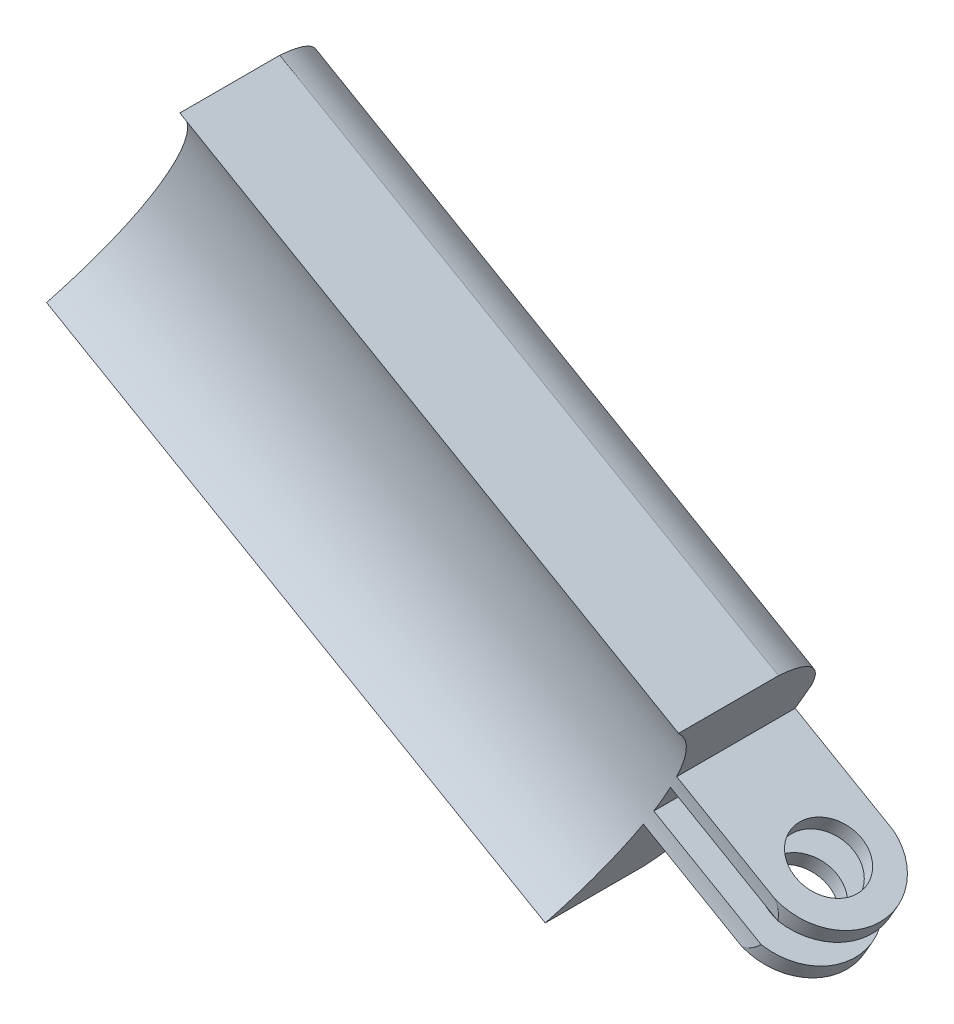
ISO-10303-21;
HEADER;
FILE_DESCRIPTION(('STEP AP214'),'2;1');
FILE_NAME('part.step','',(''),(''),'','','');
FILE_SCHEMA(('AUTOMOTIVE_DESIGN { 1 0 10303 214 1 1 1 1 }'));
ENDSEC;
DATA;
#1=APPLICATION_CONTEXT('core data for automotive mechanical design processes');
#2=APPLICATION_PROTOCOL_DEFINITION('international standard','automotive_design',2000,#1);
#3=PRODUCT_CONTEXT('',#1,'mechanical');
#4=PRODUCT('Part','Part','',(#3));
#5=PRODUCT_RELATED_PRODUCT_CATEGORY('part','',(#4));
#6=PRODUCT_DEFINITION_FORMATION('','',#4);
#7=PRODUCT_DEFINITION_CONTEXT('part definition',#1,'design');
#8=PRODUCT_DEFINITION('design','',#6,#7);
#9=PRODUCT_DEFINITION_SHAPE('','',#8);
#10=(LENGTH_UNIT() NAMED_UNIT(*) SI_UNIT(.MILLI.,.METRE.));
#11=(NAMED_UNIT(*) PLANE_ANGLE_UNIT() SI_UNIT($,.RADIAN.));
#12=(NAMED_UNIT(*) SI_UNIT($,.STERADIAN.) SOLID_ANGLE_UNIT());
#13=UNCERTAINTY_MEASURE_WITH_UNIT(LENGTH_MEASURE(1.E-05),#10,'distance_accuracy_value','');
#14=(GEOMETRIC_REPRESENTATION_CONTEXT(3) GLOBAL_UNCERTAINTY_ASSIGNED_CONTEXT((#13)) GLOBAL_UNIT_ASSIGNED_CONTEXT((#10,
#11,#12)) REPRESENTATION_CONTEXT('',''));
#15=CARTESIAN_POINT('',(0.,0.,0.));
#16=DIRECTION('',(0.,0.,1.));
#17=DIRECTION('',(1.,0.,0.));
#18=AXIS2_PLACEMENT_3D('',#15,#16,#17);
#19=CARTESIAN_POINT('',(-21.1050126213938,20.3218026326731,10.));
#20=DIRECTION('',(-0.866025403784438,0.500000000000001,0.));
#21=DIRECTION('',(-0.500000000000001,-0.866025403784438,0.));
#22=AXIS2_PLACEMENT_3D('',#19,#20,#21);
#23=PLANE('',#22);
#24=DIRECTION('',(0.,0.,-1.));
#25=VECTOR('',#24,1.);
#26=CARTESIAN_POINT('',(-18.1050126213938,25.5179550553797,7.11211234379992));
#27=LINE('',#26,#25);
#28=CARTESIAN_POINT('',(-18.1050126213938,25.5179550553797,7.11211234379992));
#29=VERTEX_POINT('',#28);
#30=CARTESIAN_POINT('',(-18.1050126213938,25.5179550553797,0.));
#31=VERTEX_POINT('',#30);
#32=EDGE_CURVE('E165',#29,#31,#27,.T.);
#33=ORIENTED_EDGE('',*,*,#32,.F.);
#34=CARTESIAN_POINT('',(-17.1050126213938,27.2500058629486,18.9442719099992));
#35=DIRECTION('',(-0.866025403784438,0.500000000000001,0.));
#36=DIRECTION('',(-0.500000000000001,-0.866025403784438,0.));
#37=AXIS2_PLACEMENT_3D('',#34,#35,#36);
#38=CIRCLE('',#37,12.);
#39=CARTESIAN_POINT('',(-21.1050126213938,20.3218026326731,10.));
#40=VERTEX_POINT('',#39);
#41=EDGE_CURVE('E11',#40,#29,#38,.F.);
#42=ORIENTED_EDGE('',*,*,#41,.F.);
#43=DIRECTION('',(0.,0.,-1.));
#44=VECTOR('',#43,1.);
#45=CARTESIAN_POINT('',(-21.1050126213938,20.3218026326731,10.));
#46=LINE('',#45,#44);
#47=CARTESIAN_POINT('',(-21.1050126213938,20.3218026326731,4.));
#48=VERTEX_POINT('',#47);
#49=EDGE_CURVE('E226',#40,#48,#46,.T.);
#50=ORIENTED_EDGE('',*,*,#49,.T.);
#51=CARTESIAN_POINT('',(-18.6472746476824,24.5787296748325,4.91547594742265));
#52=DIRECTION('',(-0.866025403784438,0.500000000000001,0.));
#53=DIRECTION('',(-0.500000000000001,-0.866025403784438,0.));
#54=AXIS2_PLACEMENT_3D('',#51,#52,#53);
#55=CIRCLE('',#54,5.);
#56=CARTESIAN_POINT('',(-19.1050126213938,23.7859042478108,0.));
#57=VERTEX_POINT('',#56);
#58=EDGE_CURVE('E199',#48,#57,#55,.F.);
#59=ORIENTED_EDGE('',*,*,#58,.T.);
#60=DIRECTION('',(0.500000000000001,0.866025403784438,0.));
#61=VECTOR('',#60,1.);
#62=CARTESIAN_POINT('',(-21.1050126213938,20.3218026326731,0.));
#63=LINE('',#62,#61);
#64=EDGE_CURVE('E212',#57,#31,#63,.T.);
#65=ORIENTED_EDGE('',*,*,#64,.T.);
#66=EDGE_LOOP('',(#33,#42,#50,#59,#65));
#67=FACE_BOUND('',#66,.T.);
#68=ADVANCED_FACE('F36',(#67),#23,.F.);
#69=DIRECTION('',(0.,0.,1.));
#70=VECTOR('',#69,1.);
#71=CARTESIAN_POINT('',(-17.6050126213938,26.3839804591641,0.));
#72=LINE('',#71,#70);
#73=CARTESIAN_POINT('',(-17.6050126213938,26.3839804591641,0.));
#74=VERTEX_POINT('',#73);
#75=CARTESIAN_POINT('',(-17.6050126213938,26.3839804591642,6.98601116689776));
#76=VERTEX_POINT('',#75);
#77=EDGE_CURVE('E175',#74,#76,#72,.T.);
#78=ORIENTED_EDGE('',*,*,#77,.F.);
#79=CARTESIAN_POINT('',(-16.6050126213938,28.116031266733,0.));
#80=VERTEX_POINT('',#79);
#81=EDGE_CURVE('E220',#74,#80,#63,.T.);
#82=ORIENTED_EDGE('',*,*,#81,.T.);
#83=DIRECTION('',(0.,0.,-1.));
#84=VECTOR('',#83,1.);
#85=CARTESIAN_POINT('',(-16.6050126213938,28.116031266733,0.));
#86=LINE('',#85,#84);
#87=CARTESIAN_POINT('',(-16.6050126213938,28.116031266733,6.98601116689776));
#88=VERTEX_POINT('',#87);
#89=EDGE_CURVE('E178',#88,#80,#86,.T.);
#90=ORIENTED_EDGE('',*,*,#89,.F.);
#91=EDGE_CURVE('E45',#76,#88,#38,.F.);
#92=ORIENTED_EDGE('',*,*,#91,.F.);
#93=EDGE_LOOP('',(#78,#82,#90,#92));
#94=FACE_BOUND('',#93,.T.);
#95=ADVANCED_FACE('F249',(#94),#23,.F.);
#96=DIRECTION('',(0.,0.,1.));
#97=VECTOR('',#96,1.);
#98=CARTESIAN_POINT('',(-16.1050126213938,28.9820566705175,7.11211234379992));
#99=LINE('',#98,#97);
#100=CARTESIAN_POINT('',(-16.1050126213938,28.9820566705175,0.));
#101=VERTEX_POINT('',#100);
#102=CARTESIAN_POINT('',(-16.1050126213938,28.9820566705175,7.11211234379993));
#103=VERTEX_POINT('',#102);
#104=EDGE_CURVE('E181',#101,#103,#99,.T.);
#105=ORIENTED_EDGE('',*,*,#104,.F.);
#106=CARTESIAN_POINT('',(-15.1050126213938,30.7141074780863,0.));
#107=VERTEX_POINT('',#106);
#108=EDGE_CURVE('E218',#101,#107,#63,.T.);
#109=ORIENTED_EDGE('',*,*,#108,.T.);
#110=CARTESIAN_POINT('',(-15.5627505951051,29.9212820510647,4.91547594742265));
#111=DIRECTION('',(-0.866025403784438,0.500000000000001,0.));
#112=DIRECTION('',(-0.500000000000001,-0.866025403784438,0.));
#113=AXIS2_PLACEMENT_3D('',#110,#111,#112);
#114=CIRCLE('',#113,5.);
#115=CARTESIAN_POINT('',(-13.1050126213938,34.1782090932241,4.));
#116=VERTEX_POINT('',#115);
#117=EDGE_CURVE('E204',#107,#116,#114,.F.);
#118=ORIENTED_EDGE('',*,*,#117,.T.);
#119=DIRECTION('',(0.,0.,-1.));
#120=VECTOR('',#119,1.);
#121=CARTESIAN_POINT('',(-13.1050126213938,34.1782090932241,10.));
#122=LINE('',#121,#120);
#123=CARTESIAN_POINT('',(-13.1050126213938,34.1782090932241,10.));
#124=VERTEX_POINT('',#123);
#125=EDGE_CURVE('E223',#124,#116,#122,.T.);
#126=ORIENTED_EDGE('',*,*,#125,.F.);
#127=EDGE_CURVE('E46',#103,#124,#38,.F.);
#128=ORIENTED_EDGE('',*,*,#127,.F.);
#129=EDGE_LOOP('',(#105,#109,#118,#126,#128));
#130=FACE_BOUND('',#129,.T.);
#131=ADVANCED_FACE('F298',(#130),#23,.F.);
#132=CARTESIAN_POINT('',(-43.0405930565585,51.4615245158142,10.));
#133=DIRECTION('',(0.866025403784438,-0.500000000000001,0.));
#134=DIRECTION('',(0.500000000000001,0.866025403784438,0.));
#135=AXIS2_PLACEMENT_3D('',#132,#133,#134);
#136=PLANE('',#135);
#137=DIRECTION('',(0.,0.,-1.));
#138=VECTOR('',#137,1.);
#139=CARTESIAN_POINT('',(-51.0405930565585,37.6051180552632,10.));
#140=LINE('',#139,#138);
#141=CARTESIAN_POINT('',(-51.0405930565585,37.6051180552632,10.));
#142=VERTEX_POINT('',#141);
#143=CARTESIAN_POINT('',(-51.0405930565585,37.6051180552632,4.));
#144=VERTEX_POINT('',#143);
#145=EDGE_CURVE('E229',#142,#144,#140,.T.);
#146=ORIENTED_EDGE('',*,*,#145,.F.);
#147=CARTESIAN_POINT('',(-47.0405930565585,44.5333212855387,18.9442719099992));
#148=DIRECTION('',(0.866025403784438,-0.500000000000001,0.));
#149=DIRECTION('',(0.500000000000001,0.866025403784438,0.));
#150=AXIS2_PLACEMENT_3D('',#147,#148,#149);
#151=CIRCLE('',#150,12.);
#152=CARTESIAN_POINT('',(-43.0405930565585,51.4615245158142,10.));
#153=VERTEX_POINT('',#152);
#154=EDGE_CURVE('E190',#142,#153,#151,.T.);
#155=ORIENTED_EDGE('',*,*,#154,.T.);
#156=DIRECTION('',(0.,0.,-1.));
#157=VECTOR('',#156,1.);
#158=CARTESIAN_POINT('',(-43.0405930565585,51.4615245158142,10.));
#159=LINE('',#158,#157);
#160=CARTESIAN_POINT('',(-43.0405930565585,51.4615245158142,4.));
#161=VERTEX_POINT('',#160);
#162=EDGE_CURVE('E215',#153,#161,#159,.T.);
#163=ORIENTED_EDGE('',*,*,#162,.T.);
#164=CARTESIAN_POINT('',(-45.4983310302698,47.2045974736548,4.91547594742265));
#165=DIRECTION('',(0.866025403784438,-0.500000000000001,0.));
#166=DIRECTION('',(-0.500000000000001,-0.866025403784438,0.));
#167=AXIS2_PLACEMENT_3D('',#164,#165,#166);
#168=CIRCLE('',#167,5.);
#169=CARTESIAN_POINT('',(-45.0405930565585,47.9974229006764,0.));
#170=VERTEX_POINT('',#169);
#171=EDGE_CURVE('E192',#170,#161,#168,.T.);
#172=ORIENTED_EDGE('',*,*,#171,.F.);
#173=DIRECTION('',(-0.500000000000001,-0.866025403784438,0.));
#174=VECTOR('',#173,1.);
#175=CARTESIAN_POINT('',(-43.0405930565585,51.4615245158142,0.));
#176=LINE('',#175,#174);
#177=CARTESIAN_POINT('',(-49.0405930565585,41.0692196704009,0.));
#178=VERTEX_POINT('',#177);
#179=EDGE_CURVE('E207',#170,#178,#176,.T.);
#180=ORIENTED_EDGE('',*,*,#179,.T.);
#181=CARTESIAN_POINT('',(-48.5828550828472,41.8620450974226,4.91547594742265));
#182=DIRECTION('',(0.866025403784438,-0.500000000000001,0.));
#183=DIRECTION('',(0.500000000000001,0.866025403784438,0.));
#184=AXIS2_PLACEMENT_3D('',#181,#182,#183);
#185=CIRCLE('',#184,5.);
#186=EDGE_CURVE('E194',#144,#178,#185,.T.);
#187=ORIENTED_EDGE('',*,*,#186,.F.);
#188=EDGE_LOOP('',(#146,#155,#163,#172,#180,#187));
#189=FACE_BOUND('',#188,.T.);
#190=ADVANCED_FACE('F38',(#189),#136,.F.);
#191=CARTESIAN_POINT('',(-51.0405930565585,37.6051180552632,10.));
#192=DIRECTION('',(0.500000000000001,0.866025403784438,0.));
#193=DIRECTION('',(-0.866025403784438,0.500000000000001,0.));
#194=AXIS2_PLACEMENT_3D('',#191,#192,#193);
#195=PLANE('',#194);
#196=ORIENTED_EDGE('',*,*,#145,.T.);
#197=DIRECTION('',(-0.866025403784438,0.500000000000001,0.));
#198=VECTOR('',#197,1.);
#199=CARTESIAN_POINT('',(-16.399576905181,17.6051180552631,4.));
#200=LINE('',#199,#198);
#201=EDGE_CURVE('E197',#48,#144,#200,.T.);
#202=ORIENTED_EDGE('',*,*,#201,.F.);
#203=ORIENTED_EDGE('',*,*,#49,.F.);
#204=DIRECTION('',(0.866025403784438,-0.500000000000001,0.));
#205=VECTOR('',#204,1.);
#206=CARTESIAN_POINT('',(-51.0405930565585,37.6051180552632,10.));
#207=LINE('',#206,#205);
#208=EDGE_CURVE('E208',#142,#40,#207,.T.);
#209=ORIENTED_EDGE('',*,*,#208,.F.);
#210=EDGE_LOOP('',(#196,#202,#203,#209));
#211=FACE_BOUND('',#210,.T.);
#212=ADVANCED_FACE('F310',(#211),#195,.F.);
#213=CARTESIAN_POINT('',(-43.0405930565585,51.4615245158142,10.));
#214=DIRECTION('',(-0.500000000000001,-0.866025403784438,0.));
#215=DIRECTION('',(0.866025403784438,-0.500000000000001,0.));
#216=AXIS2_PLACEMENT_3D('',#213,#214,#215);
#217=PLANE('',#216);
#218=ORIENTED_EDGE('',*,*,#125,.T.);
#219=DIRECTION('',(-0.866025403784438,0.500000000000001,0.));
#220=VECTOR('',#219,1.);
#221=CARTESIAN_POINT('',(-8.39957690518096,31.4615245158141,4.));
#222=LINE('',#221,#220);
#223=EDGE_CURVE('E196',#116,#161,#222,.T.);
#224=ORIENTED_EDGE('',*,*,#223,.T.);
#225=ORIENTED_EDGE('',*,*,#162,.F.);
#226=DIRECTION('',(-0.866025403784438,0.500000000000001,0.));
#227=VECTOR('',#226,1.);
#228=CARTESIAN_POINT('',(-43.0405930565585,51.4615245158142,10.));
#229=LINE('',#228,#227);
#230=EDGE_CURVE('E211',#124,#153,#229,.T.);
#231=ORIENTED_EDGE('',*,*,#230,.F.);
#232=EDGE_LOOP('',(#218,#224,#225,#231));
#233=FACE_BOUND('',#232,.T.);
#234=ADVANCED_FACE('F339',(#233),#217,.F.);
#235=CARTESIAN_POINT('',(0.,0.,0.));
#236=DIRECTION('',(0.,0.,1.));
#237=DIRECTION('',(1.,0.,0.));
#238=AXIS2_PLACEMENT_3D('',#235,#236,#237);
#239=PLANE('',#238);
#240=DIRECTION('',(-0.866025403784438,0.500000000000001,0.));
#241=VECTOR('',#240,1.);
#242=CARTESIAN_POINT('',(-7.44475858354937,23.9820566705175,0.));
#243=LINE('',#242,#241);
#244=CARTESIAN_POINT('',(-10.1955423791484,25.570222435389,0.));
#245=VERTEX_POINT('',#244);
#246=EDGE_CURVE('E61',#245,#101,#243,.T.);
#247=ORIENTED_EDGE('',*,*,#246,.F.);
#248=DIRECTION('',(-0.500000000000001,-0.866025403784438,0.));
#249=VECTOR('',#248,1.);
#250=CARTESIAN_POINT('',(-7.19554237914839,30.7663748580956,0.));
#251=LINE('',#250,#249);
#252=CARTESIAN_POINT('',(-10.6955423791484,24.7041970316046,0.));
#253=VERTEX_POINT('',#252);
#254=EDGE_CURVE('E161',#245,#253,#251,.T.);
#255=ORIENTED_EDGE('',*,*,#254,.T.);
#256=DIRECTION('',(-0.866025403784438,0.500000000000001,0.));
#257=VECTOR('',#256,1.);
#258=CARTESIAN_POINT('',(-7.94475858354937,23.116031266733,0.));
#259=LINE('',#258,#257);
#260=EDGE_CURVE('E186',#253,#80,#259,.T.);
#261=ORIENTED_EDGE('',*,*,#260,.T.);
#262=ORIENTED_EDGE('',*,*,#81,.F.);
#263=DIRECTION('',(-0.866025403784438,0.500000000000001,0.));
#264=VECTOR('',#263,1.);
#265=CARTESIAN_POINT('',(-8.94475858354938,21.3839804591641,0.));
#266=LINE('',#265,#264);
#267=CARTESIAN_POINT('',(-11.6955423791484,22.9721462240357,0.));
#268=VERTEX_POINT('',#267);
#269=EDGE_CURVE('E160',#268,#74,#266,.T.);
#270=ORIENTED_EDGE('',*,*,#269,.F.);
#271=CARTESIAN_POINT('',(-12.1955423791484,22.1061208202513,0.));
#272=VERTEX_POINT('',#271);
#273=EDGE_CURVE('E145',#268,#272,#251,.T.);
#274=ORIENTED_EDGE('',*,*,#273,.T.);
#275=DIRECTION('',(-0.866025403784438,0.500000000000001,0.));
#276=VECTOR('',#275,1.);
#277=CARTESIAN_POINT('',(-9.44475858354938,20.5179550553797,0.));
#278=LINE('',#277,#276);
#279=EDGE_CURVE('E157',#272,#31,#278,.T.);
#280=ORIENTED_EDGE('',*,*,#279,.T.);
#281=ORIENTED_EDGE('',*,*,#64,.F.);
#282=DIRECTION('',(-0.866025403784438,0.500000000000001,0.));
#283=VECTOR('',#282,1.);
#284=CARTESIAN_POINT('',(-14.399576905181,21.0692196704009,0.));
#285=LINE('',#284,#283);
#286=EDGE_CURVE('E232',#57,#178,#285,.T.);
#287=ORIENTED_EDGE('',*,*,#286,.T.);
#288=ORIENTED_EDGE('',*,*,#179,.F.);
#289=DIRECTION('',(-0.866025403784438,0.500000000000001,0.));
#290=VECTOR('',#289,1.);
#291=CARTESIAN_POINT('',(-10.399576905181,27.9974229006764,0.));
#292=LINE('',#291,#290);
#293=EDGE_CURVE('E235',#170,#107,#292,.F.);
#294=ORIENTED_EDGE('',*,*,#293,.T.);
#295=ORIENTED_EDGE('',*,*,#108,.F.);
#296=EDGE_LOOP('',(#247,#255,#261,#262,#270,#274,#280,#281,#287,#288,#294,#295));
#297=FACE_BOUND('',#296,.T.);
#298=ADVANCED_FACE('F155',(#297),#239,.F.);
#299=CARTESIAN_POINT('',(-13.9418389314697,21.8620450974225,4.91547594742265));
#300=DIRECTION('',(-0.866025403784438,0.500000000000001,0.));
#301=DIRECTION('',(-0.500000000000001,-0.866025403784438,0.));
#302=AXIS2_PLACEMENT_3D('',#299,#300,#301);
#303=CYLINDRICAL_SURFACE('',#302,5.);
#304=ORIENTED_EDGE('',*,*,#201,.T.);
#305=ORIENTED_EDGE('',*,*,#186,.T.);
#306=ORIENTED_EDGE('',*,*,#286,.F.);
#307=ORIENTED_EDGE('',*,*,#58,.F.);
#308=EDGE_LOOP('',(#304,#305,#306,#307));
#309=FACE_BOUND('',#308,.T.);
#310=ADVANCED_FACE('F331',(#309),#303,.T.);
#311=CARTESIAN_POINT('',(-10.8573148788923,27.2045974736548,4.91547594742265));
#312=DIRECTION('',(-0.866025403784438,0.500000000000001,0.));
#313=DIRECTION('',(-0.500000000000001,-0.866025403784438,0.));
#314=AXIS2_PLACEMENT_3D('',#311,#312,#313);
#315=CYLINDRICAL_SURFACE('',#314,5.);
#316=ORIENTED_EDGE('',*,*,#293,.F.);
#317=ORIENTED_EDGE('',*,*,#171,.T.);
#318=ORIENTED_EDGE('',*,*,#223,.F.);
#319=ORIENTED_EDGE('',*,*,#117,.F.);
#320=EDGE_LOOP('',(#316,#317,#318,#319));
#321=FACE_BOUND('',#320,.T.);
#322=ADVANCED_FACE('F330',(#321),#315,.T.);
#323=CARTESIAN_POINT('',(-101.262257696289,75.8382139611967,18.9442719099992));
#324=DIRECTION('',(0.866025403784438,-0.500000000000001,0.));
#325=DIRECTION('',(0.500000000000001,0.866025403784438,0.));
#326=AXIS2_PLACEMENT_3D('',#323,#324,#325);
#327=CYLINDRICAL_SURFACE('',#326,12.);
#328=CARTESIAN_POINT('',(-10.1955423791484,25.570222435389,7.11211234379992));
#329=CARTESIAN_POINT('',(-10.1779490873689,25.5344278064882,7.10835756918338));
#330=CARTESIAN_POINT('',(-10.162732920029,25.497606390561,7.10431950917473));
#331=CARTESIAN_POINT('',(-10.1365785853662,25.4226605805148,7.09588584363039));
#332=CARTESIAN_POINT('',(-10.1256242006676,25.3845417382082,7.09149167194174));
#333=CARTESIAN_POINT('',(-10.0985499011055,25.2701003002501,7.07817482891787));
#334=CARTESIAN_POINT('',(-10.0877204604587,25.1925728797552,7.06899251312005));
#335=CARTESIAN_POINT('',(-10.0743885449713,24.9994029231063,7.04653028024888));
#336=CARTESIAN_POINT('',(-10.0784055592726,24.8833807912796,7.03340604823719));
#337=CARTESIAN_POINT('',(-10.1034714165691,24.6521995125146,7.00917097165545));
#338=CARTESIAN_POINT('',(-10.1246758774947,24.5370579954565,6.99807966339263));
#339=CARTESIAN_POINT('',(-10.1753063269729,24.3302391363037,6.98049368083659));
#340=CARTESIAN_POINT('',(-10.2025773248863,24.2380553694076,6.97353143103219));
#341=CARTESIAN_POINT('',(-10.2646750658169,24.0560861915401,6.96174215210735));
#342=CARTESIAN_POINT('',(-10.2995062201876,23.9663022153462,6.95691637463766));
#343=CARTESIAN_POINT('',(-10.3757956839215,23.7895651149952,6.9495275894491));
#344=CARTESIAN_POINT('',(-10.4172508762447,23.7026106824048,6.94696352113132));
#345=CARTESIAN_POINT('',(-10.5062536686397,23.5318370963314,6.94414854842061));
#346=CARTESIAN_POINT('',(-10.553801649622,23.4480181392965,6.94389778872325));
#347=CARTESIAN_POINT('',(-10.6567674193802,23.2805996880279,6.94575258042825));
#348=CARTESIAN_POINT('',(-10.7124280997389,23.1971503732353,6.94795525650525));
#349=CARTESIAN_POINT('',(-10.8299170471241,23.0348796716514,6.95482208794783));
#350=CARTESIAN_POINT('',(-10.8917416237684,22.9560555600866,6.95948477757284));
#351=CARTESIAN_POINT('',(-11.0216625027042,22.8040642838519,6.97114320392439));
#352=CARTESIAN_POINT('',(-11.0897517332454,22.7308909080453,6.97813633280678));
#353=CARTESIAN_POINT('',(-11.2325549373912,22.5916695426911,6.99422474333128));
#354=CARTESIAN_POINT('',(-11.3072605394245,22.5256127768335,7.00331739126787));
#355=CARTESIAN_POINT('',(-11.4530198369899,22.4114422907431,7.02181354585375));
#356=CARTESIAN_POINT('',(-11.5231380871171,22.3621107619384,7.03099821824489));
#357=CARTESIAN_POINT('',(-11.6687142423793,22.2731201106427,7.05010025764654));
#358=CARTESIAN_POINT('',(-11.7441363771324,22.2334029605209,7.06001273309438));
#359=CARTESIAN_POINT('',(-11.8813902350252,22.1753272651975,7.07736050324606));
#360=CARTESIAN_POINT('',(-11.9419681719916,22.1541155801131,7.08480197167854));
#361=CARTESIAN_POINT('',(-12.0665108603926,22.1216866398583,7.0990988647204));
#362=CARTESIAN_POINT('',(-12.1305071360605,22.1105902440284,7.10594633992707));
#363=CARTESIAN_POINT('',(-12.1955423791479,22.10612082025,7.11211234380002));
#364=B_SPLINE_CURVE_WITH_KNOTS('',3,(#328,#329,#330,#331,#332,#333,#334,#335,#336,#337,#338,
#339,#340,#341,#342,#343,#344,#345,#346,#347,#348,#349,#350,#351,#352,#353,#354,#355,#356,#357,
#358,#359,#360,#361,#362,#363),.UNSPECIFIED.,.F.,.F.,(4,2,2,2,2,2,2,2,2,2,2,2,2,2,2,2,2,4),(0.,
0.119949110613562,0.239437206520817,0.474784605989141,0.823443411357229,1.17529476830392,
1.46407742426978,1.75302904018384,2.0418450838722,2.33067919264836,2.63136697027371,
2.93187579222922,3.23204945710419,3.53184860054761,3.78998138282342,4.04651502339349,
4.23958538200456,4.43493344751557),.UNSPECIFIED.);
#365=CARTESIAN_POINT('',(-10.1955423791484,25.570222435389,7.11211234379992));
#366=VERTEX_POINT('',#365);
#367=CARTESIAN_POINT('',(-10.159648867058,24.3947987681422,6.98601116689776));
#368=VERTEX_POINT('',#367);
#369=EDGE_CURVE('E257',#366,#368,#364,.T.);
#370=ORIENTED_EDGE('',*,*,#369,.F.);
#371=DIRECTION('',(-0.866025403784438,0.500000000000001,0.));
#372=VECTOR('',#371,1.);
#373=CARTESIAN_POINT('',(-7.44475858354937,23.9820566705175,7.11211234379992));
#374=LINE('',#373,#372);
#375=EDGE_CURVE('E183',#366,#103,#374,.T.);
#376=ORIENTED_EDGE('',*,*,#375,.T.);
#377=ORIENTED_EDGE('',*,*,#127,.T.);
#378=ORIENTED_EDGE('',*,*,#230,.T.);
#379=ORIENTED_EDGE('',*,*,#154,.F.);
#380=ORIENTED_EDGE('',*,*,#208,.T.);
#381=ORIENTED_EDGE('',*,*,#41,.T.);
#382=DIRECTION('',(-0.866025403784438,0.500000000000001,0.));
#383=VECTOR('',#382,1.);
#384=CARTESIAN_POINT('',(-9.44475858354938,20.5179550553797,7.11211234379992));
#385=LINE('',#384,#383);
#386=CARTESIAN_POINT('',(-12.1955423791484,22.1061208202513,7.11211234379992));
#387=VERTEX_POINT('',#386);
#388=EDGE_CURVE('E167',#387,#29,#385,.T.);
#389=ORIENTED_EDGE('',*,*,#388,.F.);
#390=CARTESIAN_POINT('',(-11.159648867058,22.6627479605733,6.98601116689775));
#391=VERTEX_POINT('',#390);
#392=EDGE_CURVE('E147',#391,#387,#364,.T.);
#393=ORIENTED_EDGE('',*,*,#392,.F.);
#394=DIRECTION('',(-0.866025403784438,0.500000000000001,0.));
#395=VECTOR('',#394,1.);
#396=CARTESIAN_POINT('',(-8.94475858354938,21.3839804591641,6.98601116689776));
#397=LINE('',#396,#395);
#398=EDGE_CURVE('E53',#391,#76,#397,.T.);
#399=ORIENTED_EDGE('',*,*,#398,.T.);
#400=ORIENTED_EDGE('',*,*,#91,.T.);
#401=DIRECTION('',(-0.866025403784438,0.500000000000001,0.));
#402=VECTOR('',#401,1.);
#403=CARTESIAN_POINT('',(-7.94475858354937,23.116031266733,6.98601116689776));
#404=LINE('',#403,#402);
#405=EDGE_CURVE('E188',#368,#88,#404,.T.);
#406=ORIENTED_EDGE('',*,*,#405,.F.);
#407=EDGE_LOOP('',(#370,#376,#377,#378,#379,#380,#381,#389,#393,#399,#400,#406));
#408=FACE_BOUND('',#407,.T.);
#409=ADVANCED_FACE('F245',(#408),#327,.F.);
#410=CARTESIAN_POINT('',(-7.94475858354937,23.116031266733,0.));
#411=DIRECTION('',(0.500000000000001,0.866025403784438,0.));
#412=DIRECTION('',(-0.866025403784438,0.500000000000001,0.));
#413=AXIS2_PLACEMENT_3D('',#410,#411,#412);
#414=PLANE('',#413);
#415=CARTESIAN_POINT('',(-11.0440503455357,24.905408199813,3.55605617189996));
#416=DIRECTION('',(0.500000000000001,0.866025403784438,0.));
#417=DIRECTION('',(-0.866025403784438,0.500000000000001,0.));
#418=AXIS2_PLACEMENT_3D('',#415,#416,#417);
#419=CIRCLE('',#418,2.);
#420=CARTESIAN_POINT('',(-12.7761011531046,25.905408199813,3.55605617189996));
#421=VERTEX_POINT('',#420);
#422=EDGE_CURVE('E151',#421,#421,#419,.T.);
#423=ORIENTED_EDGE('',*,*,#422,.T.);
#424=EDGE_LOOP('',(#423));
#425=FACE_BOUND('',#424,.T.);
#426=ORIENTED_EDGE('',*,*,#260,.F.);
#427=CARTESIAN_POINT('',(-11.0440503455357,24.905408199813,3.55605617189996));
#428=DIRECTION('',(0.500000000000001,0.866025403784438,0.));
#429=DIRECTION('',(-0.866025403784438,0.500000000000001,0.));
#430=AXIS2_PLACEMENT_3D('',#427,#428,#429);
#431=CIRCLE('',#430,3.57875386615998);
#432=EDGE_CURVE('E170',#253,#368,#431,.F.);
#433=ORIENTED_EDGE('',*,*,#432,.T.);
#434=ORIENTED_EDGE('',*,*,#405,.T.);
#435=ORIENTED_EDGE('',*,*,#89,.T.);
#436=EDGE_LOOP('',(#426,#433,#434,#435));
#437=FACE_BOUND('',#436,.T.);
#438=ADVANCED_FACE('F252',(#425,#437),#414,.F.);
#439=CARTESIAN_POINT('',(-7.44475858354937,23.9820566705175,7.11211234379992));
#440=DIRECTION('',(-0.500000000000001,-0.866025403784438,0.));
#441=DIRECTION('',(0.866025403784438,-0.500000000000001,0.));
#442=AXIS2_PLACEMENT_3D('',#439,#440,#441);
#443=PLANE('',#442);
#444=CARTESIAN_POINT('',(-10.5440503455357,25.7714336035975,3.55605617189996));
#445=DIRECTION('',(-0.500000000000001,-0.866025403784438,0.));
#446=DIRECTION('',(0.866025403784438,-0.500000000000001,0.));
#447=AXIS2_PLACEMENT_3D('',#444,#445,#446);
#448=CIRCLE('',#447,2.);
#449=CARTESIAN_POINT('',(-8.81199953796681,24.7714336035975,3.55605617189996));
#450=VERTEX_POINT('',#449);
#451=EDGE_CURVE('E273',#450,#450,#448,.T.);
#452=ORIENTED_EDGE('',*,*,#451,.T.);
#453=EDGE_LOOP('',(#452));
#454=FACE_BOUND('',#453,.T.);
#455=ORIENTED_EDGE('',*,*,#375,.F.);
#456=CARTESIAN_POINT('',(-10.5440503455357,25.7714336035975,3.55605617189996));
#457=DIRECTION('',(-0.500000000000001,-0.866025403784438,0.));
#458=DIRECTION('',(0.866025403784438,-0.500000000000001,0.));
#459=AXIS2_PLACEMENT_3D('',#456,#457,#458);
#460=CIRCLE('',#459,3.57875386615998);
#461=EDGE_CURVE('E256',#366,#245,#460,.F.);
#462=ORIENTED_EDGE('',*,*,#461,.T.);
#463=ORIENTED_EDGE('',*,*,#246,.T.);
#464=ORIENTED_EDGE('',*,*,#104,.T.);
#465=EDGE_LOOP('',(#455,#462,#463,#464));
#466=FACE_BOUND('',#465,.T.);
#467=ADVANCED_FACE('F314',(#454,#466),#443,.F.);
#468=CARTESIAN_POINT('',(-9.44475858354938,20.5179550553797,7.11211234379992));
#469=DIRECTION('',(0.500000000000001,0.866025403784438,0.));
#470=DIRECTION('',(-0.866025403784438,0.500000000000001,0.));
#471=AXIS2_PLACEMENT_3D('',#468,#469,#470);
#472=PLANE('',#471);
#473=CARTESIAN_POINT('',(-12.5440503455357,22.3073319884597,3.55605617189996));
#474=DIRECTION('',(-0.500000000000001,-0.866025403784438,0.));
#475=DIRECTION('',(0.866025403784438,-0.500000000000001,0.));
#476=AXIS2_PLACEMENT_3D('',#473,#474,#475);
#477=CIRCLE('',#476,2.);
#478=CARTESIAN_POINT('',(-10.8119995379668,21.3073319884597,3.55605617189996));
#479=VERTEX_POINT('',#478);
#480=EDGE_CURVE('E276',#479,#479,#477,.T.);
#481=ORIENTED_EDGE('',*,*,#480,.F.);
#482=EDGE_LOOP('',(#481));
#483=FACE_BOUND('',#482,.T.);
#484=ORIENTED_EDGE('',*,*,#279,.F.);
#485=CARTESIAN_POINT('',(-12.5440503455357,22.3073319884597,3.55605617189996));
#486=DIRECTION('',(0.500000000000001,0.866025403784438,0.));
#487=DIRECTION('',(-0.866025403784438,0.500000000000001,0.));
#488=AXIS2_PLACEMENT_3D('',#485,#486,#487);
#489=CIRCLE('',#488,3.57875386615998);
#490=EDGE_CURVE('E142',#387,#272,#489,.T.);
#491=ORIENTED_EDGE('',*,*,#490,.F.);
#492=ORIENTED_EDGE('',*,*,#388,.T.);
#493=ORIENTED_EDGE('',*,*,#32,.T.);
#494=EDGE_LOOP('',(#484,#491,#492,#493));
#495=FACE_BOUND('',#494,.T.);
#496=ADVANCED_FACE('F163',(#483,#495),#472,.F.);
#497=CARTESIAN_POINT('',(-8.94475858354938,21.3839804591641,0.));
#498=DIRECTION('',(-0.500000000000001,-0.866025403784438,0.));
#499=DIRECTION('',(0.866025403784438,-0.500000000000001,0.));
#500=AXIS2_PLACEMENT_3D('',#497,#498,#499);
#501=PLANE('',#500);
#502=CARTESIAN_POINT('',(-12.0440503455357,23.1733573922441,3.55605617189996));
#503=DIRECTION('',(-0.500000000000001,-0.866025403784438,0.));
#504=DIRECTION('',(0.866025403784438,-0.500000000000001,0.));
#505=AXIS2_PLACEMENT_3D('',#502,#503,#504);
#506=CIRCLE('',#505,2.);
#507=CARTESIAN_POINT('',(-10.3119995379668,22.1733573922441,3.55605617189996));
#508=VERTEX_POINT('',#507);
#509=EDGE_CURVE('E40',#508,#508,#506,.T.);
#510=ORIENTED_EDGE('',*,*,#509,.T.);
#511=EDGE_LOOP('',(#510));
#512=FACE_BOUND('',#511,.T.);
#513=ORIENTED_EDGE('',*,*,#398,.F.);
#514=CARTESIAN_POINT('',(-12.0440503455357,23.1733573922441,3.55605617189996));
#515=DIRECTION('',(-0.500000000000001,-0.866025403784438,0.));
#516=DIRECTION('',(0.866025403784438,-0.500000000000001,0.));
#517=AXIS2_PLACEMENT_3D('',#514,#515,#516);
#518=CIRCLE('',#517,3.57875386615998);
#519=EDGE_CURVE('E260',#391,#268,#518,.F.);
#520=ORIENTED_EDGE('',*,*,#519,.T.);
#521=ORIENTED_EDGE('',*,*,#269,.T.);
#522=ORIENTED_EDGE('',*,*,#77,.T.);
#523=EDGE_LOOP('',(#513,#520,#521,#522));
#524=FACE_BOUND('',#523,.T.);
#525=ADVANCED_FACE('F283',(#512,#524),#501,.F.);
#526=CARTESIAN_POINT('',(-7.54405034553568,30.9675860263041,3.55605617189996));
#527=DIRECTION('',(-0.500000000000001,-0.866025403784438,0.));
#528=DIRECTION('',(0.866025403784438,-0.500000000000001,0.));
#529=AXIS2_PLACEMENT_3D('',#526,#527,#528);
#530=CYLINDRICAL_SURFACE('',#529,3.57875386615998);
#531=ORIENTED_EDGE('',*,*,#519,.F.);
#532=ORIENTED_EDGE('',*,*,#392,.T.);
#533=ORIENTED_EDGE('',*,*,#490,.T.);
#534=ORIENTED_EDGE('',*,*,#273,.F.);
#535=EDGE_LOOP('',(#531,#532,#533,#534));
#536=FACE_BOUND('',#535,.T.);
#537=ADVANCED_FACE('F144',(#536),#530,.T.);
#538=ORIENTED_EDGE('',*,*,#254,.F.);
#539=ORIENTED_EDGE('',*,*,#461,.F.);
#540=ORIENTED_EDGE('',*,*,#369,.T.);
#541=ORIENTED_EDGE('',*,*,#432,.F.);
#542=EDGE_LOOP('',(#538,#539,#540,#541));
#543=FACE_BOUND('',#542,.T.);
#544=ADVANCED_FACE('F258',(#543),#530,.T.);
#545=CARTESIAN_POINT('',(-7.54405034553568,30.9675860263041,3.55605617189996));
#546=DIRECTION('',(-0.500000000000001,-0.866025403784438,0.));
#547=DIRECTION('',(0.866025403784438,-0.500000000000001,0.));
#548=AXIS2_PLACEMENT_3D('',#545,#546,#547);
#549=CYLINDRICAL_SURFACE('',#548,2.);
#550=ORIENTED_EDGE('',*,*,#480,.T.);
#551=EDGE_LOOP('',(#550));
#552=FACE_BOUND('',#551,.T.);
#553=ORIENTED_EDGE('',*,*,#509,.F.);
#554=EDGE_LOOP('',(#553));
#555=FACE_BOUND('',#554,.T.);
#556=ADVANCED_FACE('F286',(#552,#555),#549,.F.);
#557=ORIENTED_EDGE('',*,*,#451,.F.);
#558=EDGE_LOOP('',(#557));
#559=FACE_BOUND('',#558,.T.);
#560=ORIENTED_EDGE('',*,*,#422,.F.);
#561=EDGE_LOOP('',(#560));
#562=FACE_BOUND('',#561,.T.);
#563=ADVANCED_FACE('F288',(#559,#562),#549,.F.);
#564=CLOSED_SHELL('',(#68,#95,#131,#190,#212,#234,#298,#310,#322,#409,#438,#467,#496,#525,#537,
#544,#556,#563));
#565=MANIFOLD_SOLID_BREP('B2',#564);
#566=ADVANCED_BREP_SHAPE_REPRESENTATION('',(#18,#565),#14);
#567=SHAPE_DEFINITION_REPRESENTATION(#9,#566);
ENDSEC;
END-ISO-10303-21;
